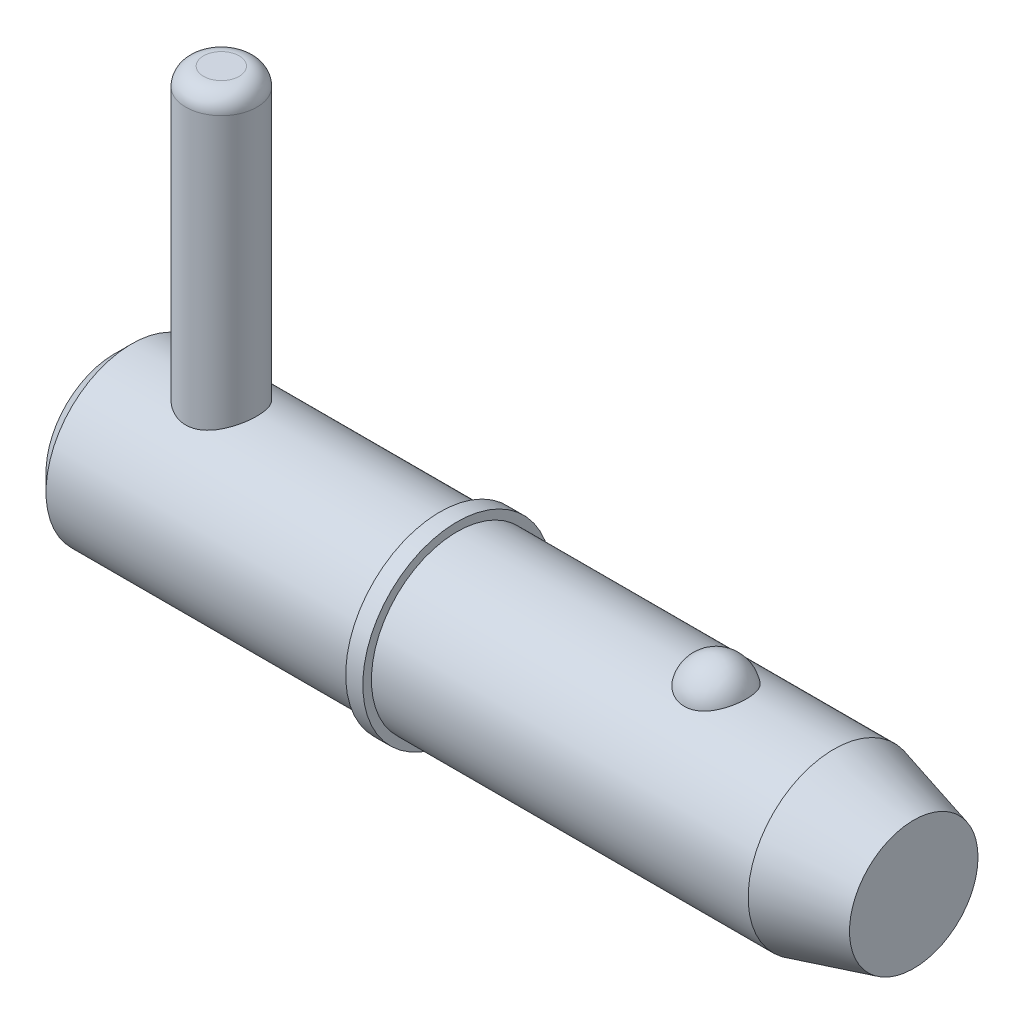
ISO-10303-21;
HEADER;
FILE_DESCRIPTION(('STEP AP214'),'2;1');
FILE_NAME('part.step','',(''),(''),'','','');
FILE_SCHEMA(('AUTOMOTIVE_DESIGN { 1 0 10303 214 1 1 1 1 }'));
ENDSEC;
DATA;
#1=APPLICATION_CONTEXT('core data for automotive mechanical design processes');
#2=APPLICATION_PROTOCOL_DEFINITION('international standard','automotive_design',2000,#1);
#3=PRODUCT_CONTEXT('',#1,'mechanical');
#4=PRODUCT('Part','Part','',(#3));
#5=PRODUCT_RELATED_PRODUCT_CATEGORY('part','',(#4));
#6=PRODUCT_DEFINITION_FORMATION('','',#4);
#7=PRODUCT_DEFINITION_CONTEXT('part definition',#1,'design');
#8=PRODUCT_DEFINITION('design','',#6,#7);
#9=PRODUCT_DEFINITION_SHAPE('','',#8);
#10=(LENGTH_UNIT() NAMED_UNIT(*) SI_UNIT(.MILLI.,.METRE.));
#11=(NAMED_UNIT(*) PLANE_ANGLE_UNIT() SI_UNIT($,.RADIAN.));
#12=(NAMED_UNIT(*) SI_UNIT($,.STERADIAN.) SOLID_ANGLE_UNIT());
#13=UNCERTAINTY_MEASURE_WITH_UNIT(LENGTH_MEASURE(1.E-05),#10,'distance_accuracy_value','');
#14=(GEOMETRIC_REPRESENTATION_CONTEXT(3) GLOBAL_UNCERTAINTY_ASSIGNED_CONTEXT((#13)) GLOBAL_UNIT_ASSIGNED_CONTEXT((#10,
#11,#12)) REPRESENTATION_CONTEXT('',''));
#15=CARTESIAN_POINT('',(0.,0.,0.));
#16=DIRECTION('',(0.,0.,1.));
#17=DIRECTION('',(1.,0.,0.));
#18=AXIS2_PLACEMENT_3D('',#15,#16,#17);
#19=CARTESIAN_POINT('',(5.94,20.635,0.));
#20=DIRECTION('',(0.,-1.,0.));
#21=DIRECTION('',(0.,0.,-1.));
#22=AXIS2_PLACEMENT_3D('',#19,#20,#21);
#23=CYLINDRICAL_SURFACE('',#22,1.98);
#24=CARTESIAN_POINT('',(5.94,-3.775,0.));
#25=DIRECTION('',(0.,1.,0.));
#26=DIRECTION('',(0.,0.,1.));
#27=AXIS2_PLACEMENT_3D('',#24,#25,#26);
#28=CIRCLE('',#27,1.98);
#29=CARTESIAN_POINT('',(5.94,-3.775,1.98));
#30=VERTEX_POINT('',#29);
#31=EDGE_CURVE('P0_E25',#30,#30,#28,.T.);
#32=ORIENTED_EDGE('',*,*,#31,.T.);
#33=EDGE_LOOP('',(#32));
#34=FACE_BOUND('',#33,.T.);
#35=CARTESIAN_POINT('',(5.94,19.645,0.));
#36=DIRECTION('',(0.,1.,0.));
#37=DIRECTION('',(0.,0.,1.));
#38=AXIS2_PLACEMENT_3D('',#35,#36,#37);
#39=CIRCLE('',#38,1.98);
#40=CARTESIAN_POINT('',(5.94,19.645,1.98));
#41=VERTEX_POINT('',#40);
#42=EDGE_CURVE('P0_E29',#41,#41,#39,.F.);
#43=ORIENTED_EDGE('',*,*,#42,.T.);
#44=EDGE_LOOP('',(#43));
#45=FACE_BOUND('',#44,.T.);
#46=ADVANCED_FACE('P0_F14',(#34,#45),#23,.T.);
#47=CARTESIAN_POINT('',(5.94,20.635,0.));
#48=DIRECTION('',(0.,1.,0.));
#49=DIRECTION('',(0.,0.,1.));
#50=AXIS2_PLACEMENT_3D('',#47,#48,#49);
#51=PLANE('',#50);
#52=CARTESIAN_POINT('',(5.94,20.635,0.));
#53=DIRECTION('',(0.,1.,0.));
#54=DIRECTION('',(0.,0.,1.));
#55=AXIS2_PLACEMENT_3D('',#52,#53,#54);
#56=CIRCLE('',#55,0.99);
#57=CARTESIAN_POINT('',(5.94,20.635,0.99));
#58=VERTEX_POINT('',#57);
#59=EDGE_CURVE('P0_E10',#58,#58,#56,.T.);
#60=ORIENTED_EDGE('',*,*,#59,.T.);
#61=EDGE_LOOP('',(#60));
#62=FACE_BOUND('',#61,.T.);
#63=ADVANCED_FACE('P0_F46',(#62),#51,.T.);
#64=CARTESIAN_POINT('',(5.94,-4.765,0.));
#65=DIRECTION('',(0.,1.,0.));
#66=DIRECTION('',(0.,0.,1.));
#67=AXIS2_PLACEMENT_3D('',#64,#65,#66);
#68=PLANE('',#67);
#69=CARTESIAN_POINT('',(5.94,-4.765,0.));
#70=DIRECTION('',(0.,1.,0.));
#71=DIRECTION('',(0.,0.,1.));
#72=AXIS2_PLACEMENT_3D('',#69,#70,#71);
#73=CIRCLE('',#72,0.99);
#74=CARTESIAN_POINT('',(5.94,-4.765,0.99));
#75=VERTEX_POINT('',#74);
#76=EDGE_CURVE('P0_E21',#75,#75,#73,.F.);
#77=ORIENTED_EDGE('',*,*,#76,.T.);
#78=EDGE_LOOP('',(#77));
#79=FACE_BOUND('',#78,.T.);
#80=ADVANCED_FACE('P0_F43',(#79),#68,.F.);
#81=CARTESIAN_POINT('',(5.94,-3.775,0.));
#82=DIRECTION('',(0.,1.,0.));
#83=DIRECTION('',(0.,0.,1.));
#84=AXIS2_PLACEMENT_3D('',#81,#82,#83);
#85=DEGENERATE_TOROIDAL_SURFACE('',#84,0.99,0.99,.T.);
#86=ORIENTED_EDGE('',*,*,#76,.F.);
#87=EDGE_LOOP('',(#86));
#88=FACE_BOUND('',#87,.T.);
#89=ORIENTED_EDGE('',*,*,#31,.F.);
#90=EDGE_LOOP('',(#89));
#91=FACE_BOUND('',#90,.T.);
#92=ADVANCED_FACE('P0_F38',(#88,#91),#85,.T.);
#93=CARTESIAN_POINT('',(5.94,19.645,0.));
#94=DIRECTION('',(0.,1.,0.));
#95=DIRECTION('',(0.,0.,1.));
#96=AXIS2_PLACEMENT_3D('',#93,#94,#95);
#97=DEGENERATE_TOROIDAL_SURFACE('',#96,0.99,0.99,.T.);
#98=ORIENTED_EDGE('',*,*,#42,.F.);
#99=EDGE_LOOP('',(#98));
#100=FACE_BOUND('',#99,.T.);
#101=ORIENTED_EDGE('',*,*,#59,.F.);
#102=EDGE_LOOP('',(#101));
#103=FACE_BOUND('',#102,.T.);
#104=ADVANCED_FACE('P0_F16',(#100,#103),#97,.T.);
#105=CLOSED_SHELL('',(#46,#63,#80,#92,#104));
#106=MANIFOLD_SOLID_BREP('P0_B1',#105);
#107=CARTESIAN_POINT('',(0.,0.,0.));
#108=DIRECTION('',(1.,0.,0.));
#109=DIRECTION('',(0.,0.,-1.));
#110=AXIS2_PLACEMENT_3D('',#107,#108,#109);
#111=CYLINDRICAL_SURFACE('',#110,4.765);
#112=CARTESIAN_POINT('',(40.0041944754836,0.,0.));
#113=DIRECTION('',(1.,0.,0.));
#114=DIRECTION('',(0.,0.,-1.));
#115=AXIS2_PLACEMENT_3D('',#112,#113,#114);
#116=CIRCLE('',#115,4.765);
#117=CARTESIAN_POINT('',(40.0041944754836,0.,-4.765));
#118=VERTEX_POINT('',#117);
#119=EDGE_CURVE('P1_E81',#118,#118,#116,.T.);
#120=ORIENTED_EDGE('',*,*,#119,.F.);
#121=EDGE_LOOP('',(#120));
#122=FACE_BOUND('',#121,.T.);
#123=CARTESIAN_POINT('',(19.05,0.,0.));
#124=DIRECTION('',(1.,0.,0.));
#125=DIRECTION('',(0.,0.,-1.));
#126=AXIS2_PLACEMENT_3D('',#123,#124,#125);
#127=CIRCLE('',#126,4.765);
#128=CARTESIAN_POINT('',(19.05,0.,-4.765));
#129=VERTEX_POINT('',#128);
#130=EDGE_CURVE('P1_E85',#129,#129,#127,.T.);
#131=ORIENTED_EDGE('',*,*,#130,.T.);
#132=EDGE_LOOP('',(#131));
#133=FACE_BOUND('',#132,.T.);
#134=CARTESIAN_POINT('',(33.451020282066,4.42764777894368,1.76101111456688));
#135=CARTESIAN_POINT('',(33.3597212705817,4.42764470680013,1.76101422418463));
#136=CARTESIAN_POINT('',(33.2684468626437,4.43059091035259,1.75366340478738));
#137=CARTESIAN_POINT('',(33.0886154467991,4.44201846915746,1.72451180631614));
#138=CARTESIAN_POINT('',(33.0000577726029,4.45049845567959,1.70271460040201));
#139=CARTESIAN_POINT('',(32.8282570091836,4.47200516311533,1.64539370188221));
#140=CARTESIAN_POINT('',(32.7450064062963,4.48502527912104,1.60988994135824));
#141=CARTESIAN_POINT('',(32.5857633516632,4.51419542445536,1.52617873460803));
#142=CARTESIAN_POINT('',(32.5097723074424,4.53034605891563,1.47796883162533));
#143=CARTESIAN_POINT('',(32.3647445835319,4.5645931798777,1.36860494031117));
#144=CARTESIAN_POINT('',(32.2959645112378,4.58273170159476,1.3071242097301));
#145=CARTESIAN_POINT('',(32.1693423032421,4.61870302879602,1.17370204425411));
#146=CARTESIAN_POINT('',(32.1115021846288,4.63653577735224,1.10175868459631));
#147=CARTESIAN_POINT('',(32.0055709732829,4.67090140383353,0.945806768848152));
#148=CARTESIAN_POINT('',(31.9580305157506,4.68734068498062,0.861402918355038));
#149=CARTESIAN_POINT('',(31.8770817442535,4.71628466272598,0.685442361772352));
#150=CARTESIAN_POINT('',(31.8436747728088,4.72878898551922,0.593884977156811));
#151=CARTESIAN_POINT('',(31.791287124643,4.74874061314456,0.404781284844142));
#152=CARTESIAN_POINT('',(31.7725178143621,4.75611366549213,0.307168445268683));
#153=CARTESIAN_POINT('',(31.7505846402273,4.76475393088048,0.109940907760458));
#154=CARTESIAN_POINT('',(31.7474205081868,4.76602124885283,0.0103262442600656));
#155=CARTESIAN_POINT('',(31.7567405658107,4.76232928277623,-0.187629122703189));
#156=CARTESIAN_POINT('',(31.7691588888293,4.7573962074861,-0.285973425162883));
#157=CARTESIAN_POINT('',(31.8092804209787,4.74184975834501,-0.479027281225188));
#158=CARTESIAN_POINT('',(31.8369839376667,4.7312362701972,-0.573736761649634));
#159=CARTESIAN_POINT('',(31.9071581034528,4.70540026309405,-0.756973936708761));
#160=CARTESIAN_POINT('',(31.9496460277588,4.69017235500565,-0.845494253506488));
#161=CARTESIAN_POINT('',(32.048520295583,4.6566986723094,-1.01378033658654));
#162=CARTESIAN_POINT('',(32.1049076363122,4.63845268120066,-1.09354547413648));
#163=CARTESIAN_POINT('',(32.230552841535,4.60085438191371,-1.24228523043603));
#164=CARTESIAN_POINT('',(32.2998439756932,4.58149930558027,-1.31123108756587));
#165=CARTESIAN_POINT('',(32.4496066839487,4.54391653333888,-1.43607409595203));
#166=CARTESIAN_POINT('',(32.5300771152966,4.52568872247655,-1.49197257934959));
#167=CARTESIAN_POINT('',(32.6981500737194,4.49293007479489,-1.58786764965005));
#168=CARTESIAN_POINT('',(32.7855445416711,4.47832346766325,-1.62820219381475));
#169=CARTESIAN_POINT('',(32.966553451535,4.45406011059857,-1.69345757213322));
#170=CARTESIAN_POINT('',(33.0601655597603,4.44440151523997,-1.71838415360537));
#171=CARTESIAN_POINT('',(33.2458939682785,4.43159888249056,-1.75112843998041));
#172=CARTESIAN_POINT('',(33.337849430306,4.42815213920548,-1.75974223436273));
#173=CARTESIAN_POINT('',(33.5219658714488,4.427247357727,-1.76201865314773));
#174=CARTESIAN_POINT('',(33.6141268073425,4.42978816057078,-1.7556841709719));
#175=CARTESIAN_POINT('',(33.7931292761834,4.4403864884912,-1.72869560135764));
#176=CARTESIAN_POINT('',(33.8800474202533,4.44827555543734,-1.70847853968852));
#177=CARTESIAN_POINT('',(34.0491314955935,4.46852246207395,-1.65479562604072));
#178=CARTESIAN_POINT('',(34.1312970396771,4.48088066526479,-1.62132869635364));
#179=CARTESIAN_POINT('',(34.2905916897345,4.50907357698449,-1.54120560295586));
#180=CARTESIAN_POINT('',(34.3675700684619,4.52497884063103,-1.49427526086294));
#181=CARTESIAN_POINT('',(34.5127080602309,4.55845148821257,-1.38881222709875));
#182=CARTESIAN_POINT('',(34.5808656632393,4.57601924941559,-1.33027689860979));
#183=CARTESIAN_POINT('',(34.7100990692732,4.61196537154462,-1.19991049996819));
#184=CARTESIAN_POINT('',(34.7706562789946,4.63034074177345,-1.12756415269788));
#185=CARTESIAN_POINT('',(34.8792797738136,4.66513959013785,-0.973612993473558));
#186=CARTESIAN_POINT('',(34.9273438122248,4.68156271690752,-0.892006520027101));
#187=CARTESIAN_POINT('',(35.011383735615,4.71130224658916,-0.718892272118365));
#188=CARTESIAN_POINT('',(35.0469185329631,4.724501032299,-0.627149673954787));
#189=CARTESIAN_POINT('',(35.1029522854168,4.74571823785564,-0.438611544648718));
#190=CARTESIAN_POINT('',(35.123450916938,4.75373654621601,-0.341815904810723));
#191=CARTESIAN_POINT('',(35.1490338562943,4.76378905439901,-0.145633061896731));
#192=CARTESIAN_POINT('',(35.154076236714,4.76580697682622,-0.046239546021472));
#193=CARTESIAN_POINT('',(35.1485239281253,4.76360573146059,0.15203857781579));
#194=CARTESIAN_POINT('',(35.1379294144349,4.75938663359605,0.250923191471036));
#195=CARTESIAN_POINT('',(35.1013875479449,4.74516937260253,0.445004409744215));
#196=CARTESIAN_POINT('',(35.0754964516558,4.73519238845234,0.540213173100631));
#197=CARTESIAN_POINT('',(35.0089273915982,4.7104939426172,0.724662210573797));
#198=CARTESIAN_POINT('',(34.968248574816,4.69577220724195,0.81390214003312));
#199=CARTESIAN_POINT('',(34.8727177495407,4.66303767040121,0.984313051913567));
#200=CARTESIAN_POINT('',(34.8178042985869,4.64501070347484,1.06544688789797));
#201=CARTESIAN_POINT('',(34.6950496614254,4.60764678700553,1.21692673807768));
#202=CARTESIAN_POINT('',(34.6272086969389,4.58830985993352,1.2872729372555));
#203=CARTESIAN_POINT('',(34.4805480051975,4.55060370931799,1.41479271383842));
#204=CARTESIAN_POINT('',(34.4017918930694,4.53222967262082,1.47203785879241));
#205=CARTESIAN_POINT('',(34.2349890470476,4.49849576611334,1.57212016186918));
#206=CARTESIAN_POINT('',(34.1469417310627,4.48313608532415,1.61495641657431));
#207=CARTESIAN_POINT('',(33.9597918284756,4.45676184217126,1.68642657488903));
#208=CARTESIAN_POINT('',(33.8603653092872,4.44598302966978,1.71430590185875));
#209=CARTESIAN_POINT('',(33.6576210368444,4.43142918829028,1.7515925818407));
#210=CARTESIAN_POINT('',(33.5543049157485,4.42765125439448,1.76100759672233));
#211=CARTESIAN_POINT('',(33.451020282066,4.42764777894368,1.76101111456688));
#212=B_SPLINE_CURVE_WITH_KNOTS('',3,(#134,#135,#136,#137,#138,#139,#140,#141,#142,#143,#144,
#145,#146,#147,#148,#149,#150,#151,#152,#153,#154,#155,#156,#157,#158,#159,#160,#161,#162,#163,
#164,#165,#166,#167,#168,#169,#170,#171,#172,#173,#174,#175,#176,#177,#178,#179,#180,#181,#182,
#183,#184,#185,#186,#187,#188,#189,#190,#191,#192,#193,#194,#195,#196,#197,#198,#199,#200,#201,
#202,#203,#204,#205,#206,#207,#208,#209,#210,#211),.UNSPECIFIED.,.T.,.F.,(4,2,2,2,2,2,2,2,2,2,2,
2,2,2,2,2,2,2,2,2,2,2,2,2,2,2,2,2,2,2,2,2,2,2,2,2,2,2,4),(0.,0.273517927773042,
0.546968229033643,0.820022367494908,1.09312934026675,1.37393946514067,1.65480131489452,
1.94820420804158,2.24163496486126,2.53922817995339,2.8368162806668,3.13315071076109,
3.42949110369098,3.72617893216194,4.02288805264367,4.32037303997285,4.61782764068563,
4.90840095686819,5.19886582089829,5.47474855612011,5.75057789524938,6.01809977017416,
6.28564340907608,6.55907787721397,6.83257454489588,7.11962987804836,7.40673679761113,
7.70312663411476,7.99952284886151,8.29672237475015,8.59391856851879,8.89002850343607,
9.18615552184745,9.483582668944,9.78100471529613,10.0767610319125,10.3725358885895,
10.6820893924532,10.991514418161),.UNSPECIFIED.);
#213=CARTESIAN_POINT('',(33.451020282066,4.42764777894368,1.76101111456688));
#214=VERTEX_POINT('',#213);
#215=EDGE_CURVE('P1_E35',#214,#214,#212,.T.);
#216=ORIENTED_EDGE('',*,*,#215,.T.);
#217=EDGE_LOOP('',(#216));
#218=FACE_BOUND('',#217,.T.);
#219=ADVANCED_FACE('P1_F13',(#122,#133,#218),#111,.T.);
#220=CARTESIAN_POINT('',(0.,0.,0.));
#221=DIRECTION('',(-1.,0.,0.));
#222=DIRECTION('',(0.,0.,1.));
#223=AXIS2_PLACEMENT_3D('',#220,#221,#222);
#224=PLANE('',#223);
#225=CARTESIAN_POINT('',(0.,0.,0.));
#226=DIRECTION('',(1.,0.,0.));
#227=DIRECTION('',(0.,0.,-1.));
#228=AXIS2_PLACEMENT_3D('',#225,#226,#227);
#229=CIRCLE('',#228,3.812);
#230=CARTESIAN_POINT('',(0.,0.,-3.812));
#231=VERTEX_POINT('',#230);
#232=EDGE_CURVE('P1_E9',#231,#231,#229,.T.);
#233=ORIENTED_EDGE('',*,*,#232,.F.);
#234=EDGE_LOOP('',(#233));
#235=FACE_BOUND('',#234,.T.);
#236=ADVANCED_FACE('P1_F15',(#235),#224,.T.);
#237=CARTESIAN_POINT('',(0.952999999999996,0.,0.));
#238=DIRECTION('',(1.,0.,0.));
#239=DIRECTION('',(0.,0.,-1.));
#240=AXIS2_PLACEMENT_3D('',#237,#238,#239);
#241=CONICAL_SURFACE('',#240,4.765,0.78539816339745);
#242=ORIENTED_EDGE('',*,*,#232,.T.);
#243=EDGE_LOOP('',(#242));
#244=FACE_BOUND('',#243,.T.);
#245=CARTESIAN_POINT('',(0.952999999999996,0.,0.));
#246=DIRECTION('',(1.,0.,0.));
#247=DIRECTION('',(0.,0.,-1.));
#248=AXIS2_PLACEMENT_3D('',#245,#246,#247);
#249=CIRCLE('',#248,4.765);
#250=CARTESIAN_POINT('',(0.952999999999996,0.,-4.765));
#251=VERTEX_POINT('',#250);
#252=EDGE_CURVE('P1_E26',#251,#251,#249,.T.);
#253=ORIENTED_EDGE('',*,*,#252,.F.);
#254=EDGE_LOOP('',(#253));
#255=FACE_BOUND('',#254,.T.);
#256=ADVANCED_FACE('P1_F77',(#244,#255),#241,.T.);
#257=CARTESIAN_POINT('',(0.,0.,0.));
#258=DIRECTION('',(1.,0.,0.));
#259=DIRECTION('',(0.,0.,-1.));
#260=AXIS2_PLACEMENT_3D('',#257,#258,#259);
#261=CYLINDRICAL_SURFACE('',#260,4.765);
#262=CARTESIAN_POINT('',(5.94,-4.33414639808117,1.98));
#263=CARTESIAN_POINT('',(5.83435484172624,-4.33415447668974,1.97999169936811));
#264=CARTESIAN_POINT('',(5.72854887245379,-4.33806396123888,1.97149330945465));
#265=CARTESIAN_POINT('',(5.51998191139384,-4.35319906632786,1.93783487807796));
#266=CARTESIAN_POINT('',(5.41723000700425,-4.3644446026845,1.91262947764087));
#267=CARTESIAN_POINT('',(5.21817294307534,-4.39274225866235,1.84670269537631));
#268=CARTESIAN_POINT('',(5.12184344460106,-4.40977076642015,1.80604432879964));
#269=CARTESIAN_POINT('',(4.93740039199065,-4.44768106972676,1.71055160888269));
#270=CARTESIAN_POINT('',(4.84928487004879,-4.46856193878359,1.65572066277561));
#271=CARTESIAN_POINT('',(4.67826533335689,-4.51326966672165,1.52981120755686));
#272=CARTESIAN_POINT('',(4.59593118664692,-4.53719608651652,1.45799365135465));
#273=CARTESIAN_POINT('',(4.44405452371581,-4.58448035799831,1.30170177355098));
#274=CARTESIAN_POINT('',(4.37451692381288,-4.60783798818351,1.21722260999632));
#275=CARTESIAN_POINT('',(4.24730683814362,-4.65256187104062,1.03353484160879));
#276=CARTESIAN_POINT('',(4.19027484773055,-4.67379892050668,0.933848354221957));
#277=CARTESIAN_POINT('',(4.0940363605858,-4.7106711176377,0.7252544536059));
#278=CARTESIAN_POINT('',(4.05482199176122,-4.72630873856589,0.61635113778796));
#279=CARTESIAN_POINT('',(3.99739515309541,-4.74951416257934,0.398397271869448));
#280=CARTESIAN_POINT('',(3.97820018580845,-4.7574579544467,0.289646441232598));
#281=CARTESIAN_POINT('',(3.95818309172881,-4.76574596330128,0.0701967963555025));
#282=CARTESIAN_POINT('',(3.95735355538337,-4.76609324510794,-0.0405012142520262));
#283=CARTESIAN_POINT('',(3.9735743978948,-4.75937098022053,-0.253561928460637));
#284=CARTESIAN_POINT('',(3.98954548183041,-4.75274912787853,-0.356023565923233));
#285=CARTESIAN_POINT('',(4.03706504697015,-4.73344665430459,-0.556659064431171));
#286=CARTESIAN_POINT('',(4.06861467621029,-4.72076558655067,-0.654832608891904));
#287=CARTESIAN_POINT('',(4.14677192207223,-4.69032846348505,-0.845904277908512));
#288=CARTESIAN_POINT('',(4.19360181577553,-4.67249797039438,-0.938699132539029));
#289=CARTESIAN_POINT('',(4.30077315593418,-4.63350852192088,-1.11535616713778));
#290=CARTESIAN_POINT('',(4.3611193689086,-4.61234839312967,-1.19921518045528));
#291=CARTESIAN_POINT('',(4.49853487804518,-4.56707259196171,-1.3618711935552));
#292=CARTESIAN_POINT('',(4.57648039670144,-4.5428537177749,-1.43990029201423));
#293=CARTESIAN_POINT('',(4.74440779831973,-4.49530722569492,-1.58211009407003));
#294=CARTESIAN_POINT('',(4.83439425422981,-4.47197995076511,-1.64628551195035));
#295=CARTESIAN_POINT('',(5.02755026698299,-4.42812342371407,-1.76092221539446));
#296=CARTESIAN_POINT('',(5.13105348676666,-4.40770990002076,-1.81086937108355));
#297=CARTESIAN_POINT('',(5.34607555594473,-4.37336901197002,-1.89231211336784));
#298=CARTESIAN_POINT('',(5.45758864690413,-4.3594370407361,-1.92382080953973));
#299=CARTESIAN_POINT('',(5.67777275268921,-4.34077746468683,-1.96554536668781));
#300=CARTESIAN_POINT('',(5.78616167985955,-4.33551319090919,-1.9770057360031));
#301=CARTESIAN_POINT('',(6.00341835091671,-4.33325118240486,-1.98196183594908));
#302=CARTESIAN_POINT('',(6.11228591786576,-4.33625061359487,-1.97546372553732));
#303=CARTESIAN_POINT('',(6.32012423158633,-4.34962383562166,-1.94582288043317));
#304=CARTESIAN_POINT('',(6.41928436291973,-4.35951709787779,-1.92376364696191));
#305=CARTESIAN_POINT('',(6.61241543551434,-4.38495043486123,-1.86506038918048));
#306=CARTESIAN_POINT('',(6.70638516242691,-4.40049182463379,-1.82841296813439));
#307=CARTESIAN_POINT('',(6.89090272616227,-4.43627016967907,-1.73985559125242));
#308=CARTESIAN_POINT('',(6.98113841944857,-4.45667771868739,-1.68736639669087));
#309=CARTESIAN_POINT('',(7.1519532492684,-4.49964530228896,-1.56919282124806));
#310=CARTESIAN_POINT('',(7.232528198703,-4.52220626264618,-1.50350275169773));
#311=CARTESIAN_POINT('',(7.38851617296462,-4.56914071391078,-1.35452895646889));
#312=CARTESIAN_POINT('',(7.46298462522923,-4.5935132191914,-1.27025197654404));
#313=CARTESIAN_POINT('',(7.59689029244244,-4.63962841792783,-1.08983181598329));
#314=CARTESIAN_POINT('',(7.65632644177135,-4.66137092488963,-0.993687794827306));
#315=CARTESIAN_POINT('',(7.75840361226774,-4.69991192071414,-0.791608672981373));
#316=CARTESIAN_POINT('',(7.80100481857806,-4.71669866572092,-0.685651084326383));
#317=CARTESIAN_POINT('',(7.86746997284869,-4.74331408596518,-0.467197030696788));
#318=CARTESIAN_POINT('',(7.8913450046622,-4.75314687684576,-0.354704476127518));
#319=CARTESIAN_POINT('',(7.91828971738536,-4.76427543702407,-0.134819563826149));
#320=CARTESIAN_POINT('',(7.92269147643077,-4.76611762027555,-0.027616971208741));
#321=CARTESIAN_POINT('',(7.91414154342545,-4.76256684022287,0.185959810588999));
#322=CARTESIAN_POINT('',(7.90119286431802,-4.75717513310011,0.292334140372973));
#323=CARTESIAN_POINT('',(7.85926572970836,-4.74004856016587,0.497383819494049));
#324=CARTESIAN_POINT('',(7.83086647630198,-4.72854322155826,0.596198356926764));
#325=CARTESIAN_POINT('',(7.75947503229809,-4.70045111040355,0.787624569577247));
#326=CARTESIAN_POINT('',(7.71648006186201,-4.68386336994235,0.880235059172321));
#327=CARTESIAN_POINT('',(7.6149456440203,-4.64628321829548,1.06122875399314));
#328=CARTESIAN_POINT('',(7.55579211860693,-4.62512577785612,1.14923242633));
#329=CARTESIAN_POINT('',(7.42451813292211,-4.58091700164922,1.31443888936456));
#330=CARTESIAN_POINT('',(7.35239289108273,-4.5578649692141,1.39163767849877));
#331=CARTESIAN_POINT('',(7.19146107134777,-4.51050832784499,1.53847013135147));
#332=CARTESIAN_POINT('',(7.10185635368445,-4.48622440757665,1.60723941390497));
#333=CARTESIAN_POINT('',(6.91164948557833,-4.44076541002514,1.72888900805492));
#334=CARTESIAN_POINT('',(6.81104124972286,-4.41959206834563,1.78176046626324));
#335=CARTESIAN_POINT('',(6.60181953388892,-4.38318936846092,1.86953227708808));
#336=CARTESIAN_POINT('',(6.49325511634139,-4.3679267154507,1.90453365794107));
#337=CARTESIAN_POINT('',(6.32681512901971,-4.35102038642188,1.94268459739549));
#338=CARTESIAN_POINT('',(6.27079191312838,-4.34638447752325,1.953006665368));
#339=CARTESIAN_POINT('',(6.15793999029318,-4.33925923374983,1.96879053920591));
#340=CARTESIAN_POINT('',(6.10111188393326,-4.33676837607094,1.97425579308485));
#341=CARTESIAN_POINT('',(6.00947316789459,-4.33456308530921,1.97908711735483));
#342=CARTESIAN_POINT('',(5.97474528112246,-4.33414374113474,1.98000272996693));
#343=CARTESIAN_POINT('',(5.94,-4.33414639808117,1.98));
#344=B_SPLINE_CURVE_WITH_KNOTS('',3,(#262,#263,#264,#265,#266,#267,#268,#269,#270,#271,#272,
#273,#274,#275,#276,#277,#278,#279,#280,#281,#282,#283,#284,#285,#286,#287,#288,#289,#290,#291,
#292,#293,#294,#295,#296,#297,#298,#299,#300,#301,#302,#303,#304,#305,#306,#307,#308,#309,#310,
#311,#312,#313,#314,#315,#316,#317,#318,#319,#320,#321,#322,#323,#324,#325,#326,#327,#328,#329,
#330,#331,#332,#333,#334,#335,#336,#337,#338,#339,#340,#341,#342,#343),.UNSPECIFIED.,.T.,.F.,(4,
2,2,2,2,2,2,2,2,2,2,2,2,2,2,2,2,2,2,2,2,2,2,2,2,2,2,2,2,2,2,2,2,2,2,2,2,2,2,2,4),(0.,
0.316814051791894,0.634491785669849,0.950887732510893,1.2672076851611,1.60127705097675,
1.93547449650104,2.28407463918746,2.63252061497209,2.96292077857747,3.29318763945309,
3.60346227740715,3.91375978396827,4.22878888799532,4.54392926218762,4.88117914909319,
5.21855748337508,5.56691259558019,5.91501972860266,6.24062939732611,6.56612741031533,
6.87094948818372,7.17584258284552,7.49361276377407,7.81152017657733,8.15513975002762,
8.4987836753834,8.8432355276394,9.18748334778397,9.50777781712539,9.8280166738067,
10.1370037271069,10.4460496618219,10.7690461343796,11.0921619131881,11.4371238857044,
11.7822776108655,12.1254577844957,12.2967183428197,12.4678572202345,12.5720531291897),.UNSPECIFIED.);
#345=CARTESIAN_POINT('',(5.94,-4.33414639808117,1.98));
#346=VERTEX_POINT('',#345);
#347=EDGE_CURVE('P1_E17',#346,#346,#344,.T.);
#348=ORIENTED_EDGE('',*,*,#347,.F.);
#349=EDGE_LOOP('',(#348));
#350=FACE_BOUND('',#349,.T.);
#351=CARTESIAN_POINT('',(5.94,4.33414639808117,1.98));
#352=CARTESIAN_POINT('',(6.04564515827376,4.33415447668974,1.97999169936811));
#353=CARTESIAN_POINT('',(6.15145112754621,4.33806396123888,1.97149330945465));
#354=CARTESIAN_POINT('',(6.36001808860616,4.35319906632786,1.93783487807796));
#355=CARTESIAN_POINT('',(6.46276999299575,4.3644446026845,1.91262947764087));
#356=CARTESIAN_POINT('',(6.66182705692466,4.39274225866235,1.84670269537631));
#357=CARTESIAN_POINT('',(6.75815655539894,4.40977076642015,1.80604432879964));
#358=CARTESIAN_POINT('',(6.94259960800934,4.44768106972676,1.71055160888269));
#359=CARTESIAN_POINT('',(7.03071512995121,4.46856193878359,1.65572066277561));
#360=CARTESIAN_POINT('',(7.20173466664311,4.51326966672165,1.52981120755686));
#361=CARTESIAN_POINT('',(7.28406881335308,4.53719608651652,1.45799365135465));
#362=CARTESIAN_POINT('',(7.43594547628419,4.58448035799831,1.30170177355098));
#363=CARTESIAN_POINT('',(7.50548307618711,4.60783798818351,1.21722260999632));
#364=CARTESIAN_POINT('',(7.63269316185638,4.65256187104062,1.03353484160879));
#365=CARTESIAN_POINT('',(7.68972515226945,4.67379892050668,0.933848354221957));
#366=CARTESIAN_POINT('',(7.7859636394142,4.7106711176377,0.7252544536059));
#367=CARTESIAN_POINT('',(7.82517800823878,4.72630873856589,0.61635113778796));
#368=CARTESIAN_POINT('',(7.88260484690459,4.74951416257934,0.398397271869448));
#369=CARTESIAN_POINT('',(7.90179981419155,4.7574579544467,0.289646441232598));
#370=CARTESIAN_POINT('',(7.92181690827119,4.76574596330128,0.0701967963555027));
#371=CARTESIAN_POINT('',(7.92264644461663,4.76609324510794,-0.040501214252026));
#372=CARTESIAN_POINT('',(7.9064256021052,4.75937098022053,-0.253561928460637));
#373=CARTESIAN_POINT('',(7.89045451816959,4.75274912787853,-0.356023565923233));
#374=CARTESIAN_POINT('',(7.84293495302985,4.73344665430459,-0.55665906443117));
#375=CARTESIAN_POINT('',(7.81138532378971,4.72076558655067,-0.654832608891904));
#376=CARTESIAN_POINT('',(7.73322807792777,4.69032846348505,-0.845904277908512));
#377=CARTESIAN_POINT('',(7.68639818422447,4.67249797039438,-0.938699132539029));
#378=CARTESIAN_POINT('',(7.57922684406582,4.63350852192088,-1.11535616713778));
#379=CARTESIAN_POINT('',(7.5188806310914,4.61234839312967,-1.19921518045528));
#380=CARTESIAN_POINT('',(7.38146512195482,4.56707259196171,-1.3618711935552));
#381=CARTESIAN_POINT('',(7.30351960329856,4.5428537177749,-1.43990029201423));
#382=CARTESIAN_POINT('',(7.13559220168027,4.49530722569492,-1.58211009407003));
#383=CARTESIAN_POINT('',(7.04560574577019,4.47197995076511,-1.64628551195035));
#384=CARTESIAN_POINT('',(6.85244973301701,4.42812342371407,-1.76092221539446));
#385=CARTESIAN_POINT('',(6.74894651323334,4.40770990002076,-1.81086937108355));
#386=CARTESIAN_POINT('',(6.53392444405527,4.37336901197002,-1.89231211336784));
#387=CARTESIAN_POINT('',(6.42241135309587,4.3594370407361,-1.92382080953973));
#388=CARTESIAN_POINT('',(6.20222724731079,4.34077746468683,-1.96554536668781));
#389=CARTESIAN_POINT('',(6.09383832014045,4.33551319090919,-1.9770057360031));
#390=CARTESIAN_POINT('',(5.87658164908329,4.33325118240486,-1.98196183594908));
#391=CARTESIAN_POINT('',(5.76771408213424,4.33625061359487,-1.97546372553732));
#392=CARTESIAN_POINT('',(5.55987576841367,4.34962383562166,-1.94582288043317));
#393=CARTESIAN_POINT('',(5.46071563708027,4.35951709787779,-1.92376364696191));
#394=CARTESIAN_POINT('',(5.26758456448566,4.38495043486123,-1.86506038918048));
#395=CARTESIAN_POINT('',(5.17361483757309,4.40049182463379,-1.82841296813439));
#396=CARTESIAN_POINT('',(4.98909727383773,4.43627016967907,-1.73985559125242));
#397=CARTESIAN_POINT('',(4.89886158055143,4.45667771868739,-1.68736639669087));
#398=CARTESIAN_POINT('',(4.72804675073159,4.49964530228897,-1.56919282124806));
#399=CARTESIAN_POINT('',(4.647471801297,4.52220626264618,-1.50350275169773));
#400=CARTESIAN_POINT('',(4.49148382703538,4.56914071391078,-1.35452895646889));
#401=CARTESIAN_POINT('',(4.41701537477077,4.5935132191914,-1.27025197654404));
#402=CARTESIAN_POINT('',(4.28310970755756,4.63962841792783,-1.08983181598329));
#403=CARTESIAN_POINT('',(4.22367355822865,4.66137092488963,-0.993687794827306));
#404=CARTESIAN_POINT('',(4.12159638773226,4.69991192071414,-0.791608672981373));
#405=CARTESIAN_POINT('',(4.07899518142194,4.71669866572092,-0.685651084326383));
#406=CARTESIAN_POINT('',(4.01253002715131,4.74331408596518,-0.467197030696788));
#407=CARTESIAN_POINT('',(3.98865499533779,4.75314687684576,-0.354704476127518));
#408=CARTESIAN_POINT('',(3.96171028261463,4.76427543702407,-0.134819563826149));
#409=CARTESIAN_POINT('',(3.95730852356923,4.76611762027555,-0.0276169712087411));
#410=CARTESIAN_POINT('',(3.96585845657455,4.76256684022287,0.185959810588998));
#411=CARTESIAN_POINT('',(3.97880713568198,4.75717513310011,0.292334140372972));
#412=CARTESIAN_POINT('',(4.02073427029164,4.74004856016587,0.497383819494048));
#413=CARTESIAN_POINT('',(4.04913352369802,4.72854322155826,0.596198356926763));
#414=CARTESIAN_POINT('',(4.12052496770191,4.70045111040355,0.787624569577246));
#415=CARTESIAN_POINT('',(4.16351993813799,4.68386336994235,0.880235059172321));
#416=CARTESIAN_POINT('',(4.2650543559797,4.64628321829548,1.06122875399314));
#417=CARTESIAN_POINT('',(4.32420788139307,4.62512577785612,1.14923242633));
#418=CARTESIAN_POINT('',(4.45548186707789,4.58091700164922,1.31443888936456));
#419=CARTESIAN_POINT('',(4.52760710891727,4.5578649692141,1.39163767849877));
#420=CARTESIAN_POINT('',(4.68853892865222,4.51050832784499,1.53847013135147));
#421=CARTESIAN_POINT('',(4.77814364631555,4.48622440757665,1.60723941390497));
#422=CARTESIAN_POINT('',(4.96835051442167,4.44076541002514,1.72888900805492));
#423=CARTESIAN_POINT('',(5.06895875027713,4.41959206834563,1.78176046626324));
#424=CARTESIAN_POINT('',(5.27818046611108,4.38318936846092,1.86953227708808));
#425=CARTESIAN_POINT('',(5.38674488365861,4.3679267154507,1.90453365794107));
#426=CARTESIAN_POINT('',(5.55318487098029,4.35102038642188,1.94268459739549));
#427=CARTESIAN_POINT('',(5.60920808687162,4.34638447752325,1.953006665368));
#428=CARTESIAN_POINT('',(5.72206000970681,4.33925923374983,1.96879053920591));
#429=CARTESIAN_POINT('',(5.77888811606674,4.33676837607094,1.97425579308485));
#430=CARTESIAN_POINT('',(5.87052683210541,4.33456308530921,1.97908711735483));
#431=CARTESIAN_POINT('',(5.90525471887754,4.33414374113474,1.98000272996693));
#432=CARTESIAN_POINT('',(5.94,4.33414639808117,1.98));
#433=B_SPLINE_CURVE_WITH_KNOTS('',3,(#351,#352,#353,#354,#355,#356,#357,#358,#359,#360,#361,
#362,#363,#364,#365,#366,#367,#368,#369,#370,#371,#372,#373,#374,#375,#376,#377,#378,#379,#380,
#381,#382,#383,#384,#385,#386,#387,#388,#389,#390,#391,#392,#393,#394,#395,#396,#397,#398,#399,
#400,#401,#402,#403,#404,#405,#406,#407,#408,#409,#410,#411,#412,#413,#414,#415,#416,#417,#418,
#419,#420,#421,#422,#423,#424,#425,#426,#427,#428,#429,#430,#431,#432),.UNSPECIFIED.,.T.,.F.,(4,
2,2,2,2,2,2,2,2,2,2,2,2,2,2,2,2,2,2,2,2,2,2,2,2,2,2,2,2,2,2,2,2,2,2,2,2,2,2,2,4),(0.,
0.316814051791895,0.634491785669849,0.950887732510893,1.2672076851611,1.60127705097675,
1.93547449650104,2.28407463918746,2.63252061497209,2.96292077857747,3.29318763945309,
3.60346227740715,3.91375978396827,4.22878888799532,4.54392926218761,4.88117914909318,
5.21855748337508,5.56691259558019,5.91501972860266,6.24062939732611,6.56612741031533,
6.87094948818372,7.17584258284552,7.49361276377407,7.81152017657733,8.15513975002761,
8.4987836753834,8.84323552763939,9.18748334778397,9.50777781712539,9.8280166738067,
10.1370037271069,10.4460496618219,10.7690461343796,11.0921619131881,11.4371238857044,
11.7822776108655,12.1254577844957,12.2967183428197,12.4678572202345,12.5720531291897),.UNSPECIFIED.);
#434=CARTESIAN_POINT('',(5.94,4.33414639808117,1.98));
#435=VERTEX_POINT('',#434);
#436=EDGE_CURVE('P1_E43',#435,#435,#433,.T.);
#437=ORIENTED_EDGE('',*,*,#436,.F.);
#438=EDGE_LOOP('',(#437));
#439=FACE_BOUND('',#438,.T.);
#440=ORIENTED_EDGE('',*,*,#252,.T.);
#441=EDGE_LOOP('',(#440));
#442=FACE_BOUND('',#441,.T.);
#443=CARTESIAN_POINT('',(18.097,0.,0.));
#444=DIRECTION('',(1.,0.,0.));
#445=DIRECTION('',(0.,0.,-1.));
#446=AXIS2_PLACEMENT_3D('',#443,#444,#445);
#447=CIRCLE('',#446,4.765);
#448=CARTESIAN_POINT('',(18.097,0.,-4.765));
#449=VERTEX_POINT('',#448);
#450=EDGE_CURVE('P1_E31',#449,#449,#447,.T.);
#451=ORIENTED_EDGE('',*,*,#450,.F.);
#452=EDGE_LOOP('',(#451));
#453=FACE_BOUND('',#452,.T.);
#454=ADVANCED_FACE('P1_F103',(#350,#439,#442,#453),#261,.T.);
#455=CARTESIAN_POINT('',(18.097,4.765,0.));
#456=DIRECTION('',(-1.,0.,0.));
#457=DIRECTION('',(0.,0.,1.));
#458=AXIS2_PLACEMENT_3D('',#455,#456,#457);
#459=PLANE('',#458);
#460=ORIENTED_EDGE('',*,*,#450,.T.);
#461=EDGE_LOOP('',(#460));
#462=FACE_BOUND('',#461,.T.);
#463=CARTESIAN_POINT('',(18.097,0.,0.));
#464=DIRECTION('',(1.,0.,0.));
#465=DIRECTION('',(0.,0.,-1.));
#466=AXIS2_PLACEMENT_3D('',#463,#464,#465);
#467=CIRCLE('',#466,5.2415);
#468=CARTESIAN_POINT('',(18.097,0.,-5.2415));
#469=VERTEX_POINT('',#468);
#470=EDGE_CURVE('P1_E91',#469,#469,#467,.T.);
#471=ORIENTED_EDGE('',*,*,#470,.F.);
#472=EDGE_LOOP('',(#471));
#473=FACE_BOUND('',#472,.T.);
#474=ADVANCED_FACE('P1_F100',(#462,#473),#459,.T.);
#475=CARTESIAN_POINT('',(0.,0.,0.));
#476=DIRECTION('',(1.,0.,0.));
#477=DIRECTION('',(0.,0.,-1.));
#478=AXIS2_PLACEMENT_3D('',#475,#476,#477);
#479=CYLINDRICAL_SURFACE('',#478,5.2415);
#480=ORIENTED_EDGE('',*,*,#470,.T.);
#481=EDGE_LOOP('',(#480));
#482=FACE_BOUND('',#481,.T.);
#483=CARTESIAN_POINT('',(19.05,0.,0.));
#484=DIRECTION('',(1.,0.,0.));
#485=DIRECTION('',(0.,0.,-1.));
#486=AXIS2_PLACEMENT_3D('',#483,#484,#485);
#487=CIRCLE('',#486,5.2415);
#488=CARTESIAN_POINT('',(19.05,0.,-5.2415));
#489=VERTEX_POINT('',#488);
#490=EDGE_CURVE('P1_E88',#489,#489,#487,.T.);
#491=ORIENTED_EDGE('',*,*,#490,.F.);
#492=EDGE_LOOP('',(#491));
#493=FACE_BOUND('',#492,.T.);
#494=ADVANCED_FACE('P1_F68',(#482,#493),#479,.T.);
#495=CARTESIAN_POINT('',(19.05,5.2415,0.));
#496=DIRECTION('',(1.,0.,0.));
#497=DIRECTION('',(0.,0.,-1.));
#498=AXIS2_PLACEMENT_3D('',#495,#496,#497);
#499=PLANE('',#498);
#500=ORIENTED_EDGE('',*,*,#490,.T.);
#501=EDGE_LOOP('',(#500));
#502=FACE_BOUND('',#501,.T.);
#503=ORIENTED_EDGE('',*,*,#130,.F.);
#504=EDGE_LOOP('',(#503));
#505=FACE_BOUND('',#504,.T.);
#506=ADVANCED_FACE('P1_F62',(#502,#505),#499,.T.);
#507=CARTESIAN_POINT('',(44.45,0.,0.));
#508=DIRECTION('',(-1.,0.,0.));
#509=DIRECTION('',(0.,0.,1.));
#510=AXIS2_PLACEMENT_3D('',#507,#508,#509);
#511=CONICAL_SURFACE('',#510,3.57375000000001,0.26179938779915);
#512=ORIENTED_EDGE('',*,*,#119,.T.);
#513=EDGE_LOOP('',(#512));
#514=FACE_BOUND('',#513,.T.);
#515=CARTESIAN_POINT('',(44.45,0.,0.));
#516=DIRECTION('',(1.,0.,0.));
#517=DIRECTION('',(0.,0.,-1.));
#518=AXIS2_PLACEMENT_3D('',#515,#516,#517);
#519=CIRCLE('',#518,3.57375000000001);
#520=CARTESIAN_POINT('',(44.45,0.,-3.57375000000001));
#521=VERTEX_POINT('',#520);
#522=EDGE_CURVE('P1_E42',#521,#521,#519,.T.);
#523=ORIENTED_EDGE('',*,*,#522,.F.);
#524=EDGE_LOOP('',(#523));
#525=FACE_BOUND('',#524,.T.);
#526=ADVANCED_FACE('P1_F59',(#514,#525),#511,.T.);
#527=CARTESIAN_POINT('',(44.45,3.57375000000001,0.));
#528=DIRECTION('',(1.,0.,0.));
#529=DIRECTION('',(0.,0.,-1.));
#530=AXIS2_PLACEMENT_3D('',#527,#528,#529);
#531=PLANE('',#530);
#532=ORIENTED_EDGE('',*,*,#522,.T.);
#533=EDGE_LOOP('',(#532));
#534=FACE_BOUND('',#533,.T.);
#535=ADVANCED_FACE('P1_F55',(#534),#531,.T.);
#536=CARTESIAN_POINT('',(33.451020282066,4.2885,0.));
#537=DIRECTION('',(-1.,0.,0.));
#538=DIRECTION('',(0.,1.,0.));
#539=AXIS2_PLACEMENT_3D('',#536,#537,#538);
#540=SPHERICAL_SURFACE('',#539,1.7665);
#541=ORIENTED_EDGE('',*,*,#215,.F.);
#542=EDGE_LOOP('',(#541));
#543=FACE_BOUND('',#542,.T.);
#544=ADVANCED_FACE('P1_F50',(#543),#540,.T.);
#545=CARTESIAN_POINT('',(5.94,-5.2415,0.));
#546=DIRECTION('',(0.,1.,0.));
#547=DIRECTION('',(0.,0.,1.));
#548=AXIS2_PLACEMENT_3D('',#545,#546,#547);
#549=CYLINDRICAL_SURFACE('',#548,1.98);
#550=ORIENTED_EDGE('',*,*,#347,.T.);
#551=EDGE_LOOP('',(#550));
#552=FACE_BOUND('',#551,.T.);
#553=ORIENTED_EDGE('',*,*,#436,.T.);
#554=EDGE_LOOP('',(#553));
#555=FACE_BOUND('',#554,.T.);
#556=ADVANCED_FACE('P1_F54',(#552,#555),#549,.F.);
#557=CLOSED_SHELL('',(#219,#236,#256,#454,#474,#494,#506,#526,#535,#544,#556));
#558=MANIFOLD_SOLID_BREP('P1_B1',#557);
#559=ADVANCED_BREP_SHAPE_REPRESENTATION('',(#18,#106,#558),#14);
#560=SHAPE_DEFINITION_REPRESENTATION(#9,#559);
ENDSEC;
END-ISO-10303-21;
